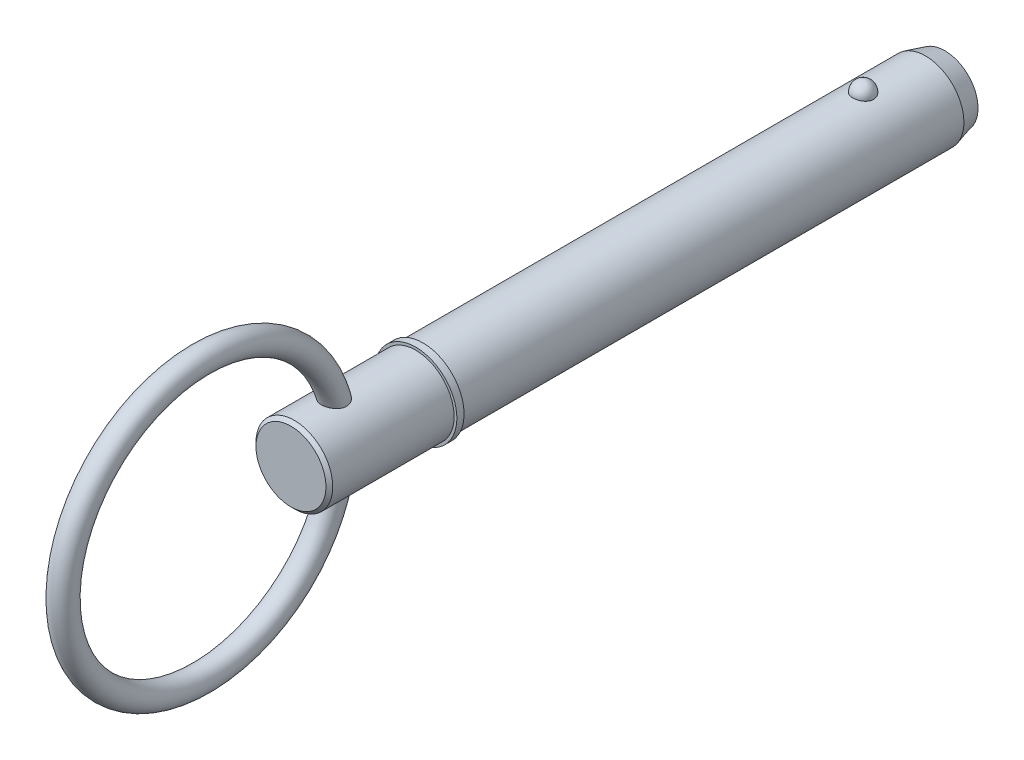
from build123d import *

# Parameters (mm, degrees)
SKETCH2_R           = 7.94
BOSS_EXTRUDE1_DEPTH = 88.9
BOSS_EXTRUDE2_START = 19.05
SKETCH3_R           = 7.94
BOSS_EXTRUDE2_DEPTH = 19.05
CHAMFER1_SIZE       = 4
CHAMFER1_SIZE2      = 1.07179677
SKETCH20_W          = 1.5
SKETCH20_H          = 8.5
SKETCH21_R          = 7.94
BOSS_EXTRUDE3_DEPTH = 27.31
CHAMFER2_SIZE       = 0.7
SKETCH24_R          = 2.5


with BuildPart() as part:
    # Sketch2 → Boss-Extrude1 (new body)
    with BuildSketch(Plane.XY):
        Circle(SKETCH2_R)
    extrude(amount=BOSS_EXTRUDE1_DEPTH)

    # Sketch3 → Boss-Extrude2 (add)
    with BuildSketch(Plane(origin=(0, 0, 0), x_dir=(-1, 0, 0), z_dir=(0, 0, -1)).offset(BOSS_EXTRUDE2_START)):
        Circle(SKETCH3_R)
    extrude(amount=-BOSS_EXTRUDE2_DEPTH)

    # Chamfer1
    chamfer1_edges = [part.edges().sort_by_distance(p)[0] for p in [
        (7.94, 0, -19.05),
    ]]
    chamfer1_side = [part.faces().sort_by_distance(p)[0] for p in [
        (7.94, 0, -9.525),
    ]]
    chamfer(chamfer1_edges, length=CHAMFER1_SIZE, length2=CHAMFER1_SIZE2, reference=chamfer1_side[0])

    # Sketch18 → Revolve1 (revolve)
    with BuildSketch(Plane(origin=(0, 0, 0), x_dir=(0, 0, -1), z_dir=(1, 0, 0))):
        with BuildLine():
            Line((2.15, 10.09), (2.15, 5.79))
            ThreePointArc((2.15, 5.79), (0, 7.94), (2.15, 10.09))
        make_face()
    revolve(axis=Axis((0, 10.09, -2.15), (0, -1, 0)))

    # Sketch20 → Revolve2 (revolve)
    with BuildSketch(Plane(origin=(0, 0, 0), x_dir=(0, 0, -1), z_dir=(1, 0, 0)), mode=Mode.PRIVATE) as revolve2_sk:
        with Locations((-89.65, 4.25)):
            Rectangle(SKETCH20_W, SKETCH20_H)
    revolve(revolve2_sk.sketch.rotate(Axis((0, 0, 33.728787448), (0, 0, 1)), 90), axis=Axis((0, 0, 33.728787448), (0, 0, 1)))

    # Sketch21 → Boss-Extrude3 (add)
    with BuildSketch(Plane(origin=(0, 0, 88.9), x_dir=(-1, 0, 0), z_dir=(0, 0, -1))):
        Circle(SKETCH21_R)
    extrude(amount=-BOSS_EXTRUDE3_DEPTH)

    # Chamfer2
    chamfer2_edges = [part.edges().sort_by_distance(p)[0] for p in [
        (7.94, 0, 116.21),
    ]]
    chamfer(chamfer2_edges, length=CHAMFER2_SIZE)

    # Sweep1: sweep along a path in Sketch23
    with BuildLine(Plane(origin=(0, 0, 0), x_dir=(0, 0, -1), z_dir=(1, 0, 0))) as sweep1_path:
        CenterArc((-134.785, 0), 28.575, 0, 360)
    # Sketch24 → Sweep1 (sweep)
    with BuildSketch(Plane(origin=(0, 0, 0), x_dir=(1, 0, 0), z_dir=(0, 1, 0))):
        with Locations((0, -106.21)):
            Circle(SKETCH24_R)
    sweep(path=sweep1_path.line)


solid = part.part
